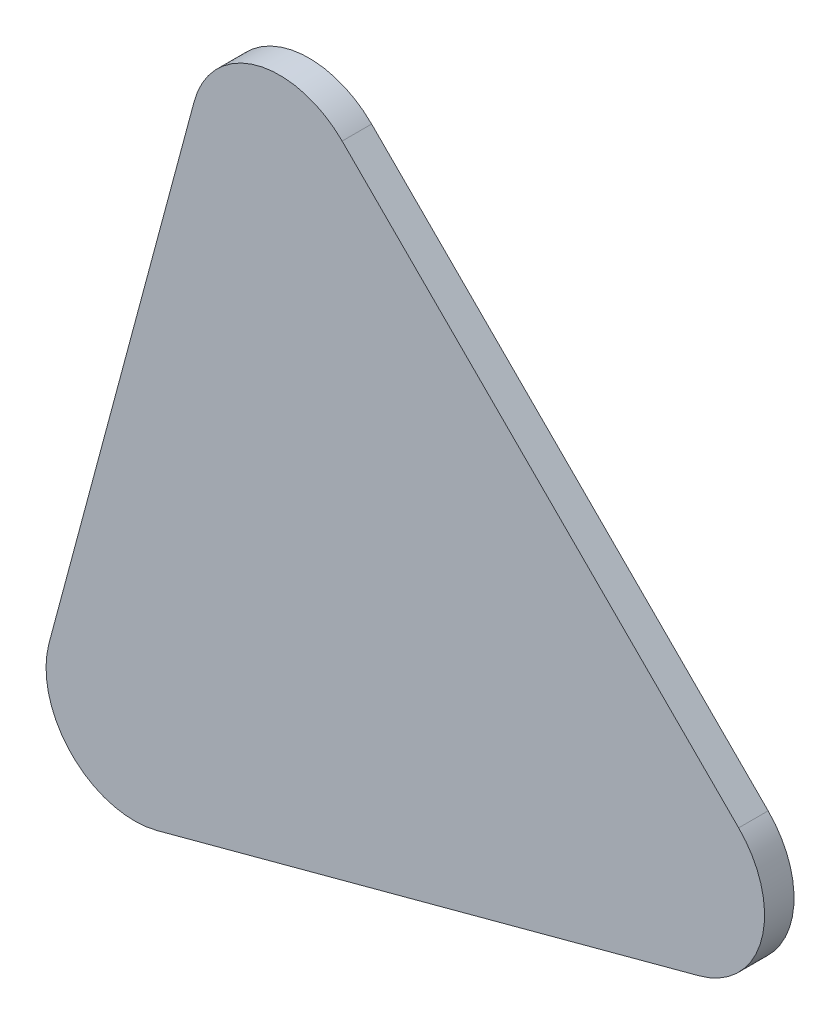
ISO-10303-21;
HEADER;
FILE_DESCRIPTION(('STEP AP214'),'2;1');
FILE_NAME('part.step','',(''),(''),'','','');
FILE_SCHEMA(('AUTOMOTIVE_DESIGN { 1 0 10303 214 1 1 1 1 }'));
ENDSEC;
DATA;
#1=APPLICATION_CONTEXT('core data for automotive mechanical design processes');
#2=APPLICATION_PROTOCOL_DEFINITION('international standard','automotive_design',2000,#1);
#3=PRODUCT_CONTEXT('',#1,'mechanical');
#4=PRODUCT('Part','Part','',(#3));
#5=PRODUCT_RELATED_PRODUCT_CATEGORY('part','',(#4));
#6=PRODUCT_DEFINITION_FORMATION('','',#4);
#7=PRODUCT_DEFINITION_CONTEXT('part definition',#1,'design');
#8=PRODUCT_DEFINITION('design','',#6,#7);
#9=PRODUCT_DEFINITION_SHAPE('','',#8);
#10=(LENGTH_UNIT() NAMED_UNIT(*) SI_UNIT(.MILLI.,.METRE.));
#11=(NAMED_UNIT(*) PLANE_ANGLE_UNIT() SI_UNIT($,.RADIAN.));
#12=(NAMED_UNIT(*) SI_UNIT($,.STERADIAN.) SOLID_ANGLE_UNIT());
#13=UNCERTAINTY_MEASURE_WITH_UNIT(LENGTH_MEASURE(1.E-05),#10,'distance_accuracy_value','');
#14=(GEOMETRIC_REPRESENTATION_CONTEXT(3) GLOBAL_UNCERTAINTY_ASSIGNED_CONTEXT((#13)) GLOBAL_UNIT_ASSIGNED_CONTEXT((#10,
#11,#12)) REPRESENTATION_CONTEXT('',''));
#15=CARTESIAN_POINT('',(0.,0.,0.));
#16=DIRECTION('',(0.,0.,1.));
#17=DIRECTION('',(1.,0.,0.));
#18=AXIS2_PLACEMENT_3D('',#15,#16,#17);
#19=CARTESIAN_POINT('',(-7.6135520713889,-28.4141631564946,1.));
#20=DIRECTION('',(0.965925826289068,-0.258819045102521,0.));
#21=DIRECTION('',(0.258819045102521,0.965925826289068,0.));
#22=AXIS2_PLACEMENT_3D('',#19,#20,#21);
#23=PLANE('',#22);
#24=DIRECTION('',(-0.258819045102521,-0.965925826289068,0.));
#25=VECTOR('',#24,1.);
#26=CARTESIAN_POINT('',(-7.6135520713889,-28.4141631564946,0.));
#27=LINE('',#26,#25);
#28=CARTESIAN_POINT('',(-1.34486320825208,-5.01909782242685,0.));
#29=VERTEX_POINT('',#28);
#30=CARTESIAN_POINT('',(-6.26868886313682,-23.3950653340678,0.));
#31=VERTEX_POINT('',#30);
#32=EDGE_CURVE('E112',#29,#31,#27,.T.);
#33=ORIENTED_EDGE('',*,*,#32,.T.);
#34=DIRECTION('',(0.,0.,-1.));
#35=VECTOR('',#34,1.);
#36=CARTESIAN_POINT('',(-6.26868886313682,-23.3950653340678,1.));
#37=LINE('',#36,#35);
#38=CARTESIAN_POINT('',(-6.26868886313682,-23.3950653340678,1.));
#39=VERTEX_POINT('',#38);
#40=EDGE_CURVE('E91',#31,#39,#37,.F.);
#41=ORIENTED_EDGE('',*,*,#40,.T.);
#42=DIRECTION('',(-0.258819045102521,-0.965925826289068,0.));
#43=VECTOR('',#42,1.);
#44=CARTESIAN_POINT('',(-7.6135520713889,-28.4141631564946,1.));
#45=LINE('',#44,#43);
#46=CARTESIAN_POINT('',(-1.34486320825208,-5.01909782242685,1.));
#47=VERTEX_POINT('',#46);
#48=EDGE_CURVE('E114',#47,#39,#45,.T.);
#49=ORIENTED_EDGE('',*,*,#48,.F.);
#50=DIRECTION('',(0.,0.,-1.));
#51=VECTOR('',#50,1.);
#52=CARTESIAN_POINT('',(-1.34486320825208,-5.01909782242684,1.));
#53=LINE('',#52,#51);
#54=EDGE_CURVE('E96',#47,#29,#53,.T.);
#55=ORIENTED_EDGE('',*,*,#54,.T.);
#56=EDGE_LOOP('',(#33,#41,#49,#55));
#57=FACE_BOUND('',#56,.T.);
#58=ADVANCED_FACE('F33',(#57),#23,.F.);
#59=CARTESIAN_POINT('',(20.8006110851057,-20.8006110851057,1.));
#60=DIRECTION('',(-0.258819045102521,0.965925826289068,0.));
#61=DIRECTION('',(-0.965925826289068,-0.258819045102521,0.));
#62=AXIS2_PLACEMENT_3D('',#59,#60,#61);
#63=PLANE('',#62);
#64=DIRECTION('',(0.965925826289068,0.258819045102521,0.));
#65=VECTOR('',#64,1.);
#66=CARTESIAN_POINT('',(20.8006110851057,-20.8006110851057,1.));
#67=LINE('',#66,#65);
#68=CARTESIAN_POINT('',(-2.59445424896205,-27.0692999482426,1.));
#69=VERTEX_POINT('',#68);
#70=CARTESIAN_POINT('',(15.7815132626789,-22.1454742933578,1.));
#71=VERTEX_POINT('',#70);
#72=EDGE_CURVE('E105',#69,#71,#67,.T.);
#73=ORIENTED_EDGE('',*,*,#72,.F.);
#74=DIRECTION('',(0.,0.,-1.));
#75=VECTOR('',#74,1.);
#76=CARTESIAN_POINT('',(-2.59445424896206,-27.0692999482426,1.));
#77=LINE('',#76,#75);
#78=CARTESIAN_POINT('',(-2.59445424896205,-27.0692999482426,0.));
#79=VERTEX_POINT('',#78);
#80=EDGE_CURVE('E90',#69,#79,#77,.T.);
#81=ORIENTED_EDGE('',*,*,#80,.T.);
#82=DIRECTION('',(0.965925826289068,0.258819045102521,0.));
#83=VECTOR('',#82,1.);
#84=CARTESIAN_POINT('',(20.8006110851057,-20.8006110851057,0.));
#85=LINE('',#84,#83);
#86=CARTESIAN_POINT('',(15.7815132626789,-22.1454742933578,0.));
#87=VERTEX_POINT('',#86);
#88=EDGE_CURVE('E103',#79,#87,#85,.T.);
#89=ORIENTED_EDGE('',*,*,#88,.T.);
#90=DIRECTION('',(0.,0.,-1.));
#91=VECTOR('',#90,1.);
#92=CARTESIAN_POINT('',(15.7815132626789,-22.1454742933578,1.));
#93=LINE('',#92,#91);
#94=EDGE_CURVE('E107',#87,#71,#93,.F.);
#95=ORIENTED_EDGE('',*,*,#94,.T.);
#96=EDGE_LOOP('',(#73,#81,#89,#95));
#97=FACE_BOUND('',#96,.T.);
#98=ADVANCED_FACE('F102',(#97),#63,.F.);
#99=CARTESIAN_POINT('',(0.,0.,1.));
#100=DIRECTION('',(-0.707106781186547,-0.707106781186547,0.));
#101=DIRECTION('',(0.707106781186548,-0.707106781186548,0.));
#102=AXIS2_PLACEMENT_3D('',#99,#100,#101);
#103=PLANE('',#102);
#104=DIRECTION('',(-0.707106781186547,0.707106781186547,0.));
#105=VECTOR('',#104,1.);
#106=CARTESIAN_POINT('',(0.,0.,0.));
#107=LINE('',#106,#105);
#108=CARTESIAN_POINT('',(17.126376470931,-17.126376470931,0.));
#109=VERTEX_POINT('',#108);
#110=CARTESIAN_POINT('',(3.67423461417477,-3.67423461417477,0.));
#111=VERTEX_POINT('',#110);
#112=EDGE_CURVE('E111',#109,#111,#107,.T.);
#113=ORIENTED_EDGE('',*,*,#112,.T.);
#114=DIRECTION('',(0.,0.,-1.));
#115=VECTOR('',#114,1.);
#116=CARTESIAN_POINT('',(3.67423461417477,-3.67423461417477,1.));
#117=LINE('',#116,#115);
#118=CARTESIAN_POINT('',(3.67423461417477,-3.67423461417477,1.));
#119=VERTEX_POINT('',#118);
#120=EDGE_CURVE('E11',#111,#119,#117,.F.);
#121=ORIENTED_EDGE('',*,*,#120,.T.);
#122=DIRECTION('',(-0.707106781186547,0.707106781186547,0.));
#123=VECTOR('',#122,1.);
#124=CARTESIAN_POINT('',(0.,0.,1.));
#125=LINE('',#124,#123);
#126=CARTESIAN_POINT('',(17.126376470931,-17.126376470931,1.));
#127=VERTEX_POINT('',#126);
#128=EDGE_CURVE('E119',#127,#119,#125,.T.);
#129=ORIENTED_EDGE('',*,*,#128,.F.);
#130=DIRECTION('',(0.,0.,-1.));
#131=VECTOR('',#130,1.);
#132=CARTESIAN_POINT('',(17.126376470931,-17.126376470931,1.));
#133=LINE('',#132,#131);
#134=EDGE_CURVE('E41',#127,#109,#133,.T.);
#135=ORIENTED_EDGE('',*,*,#134,.T.);
#136=EDGE_LOOP('',(#113,#121,#129,#135));
#137=FACE_BOUND('',#136,.T.);
#138=ADVANCED_FACE('F132',(#137),#103,.F.);
#139=CARTESIAN_POINT('',(0.,0.,1.));
#140=DIRECTION('',(0.,0.,-1.));
#141=DIRECTION('',(-1.,0.,0.));
#142=AXIS2_PLACEMENT_3D('',#139,#140,#141);
#143=PLANE('',#142);
#144=ORIENTED_EDGE('',*,*,#48,.T.);
#145=CARTESIAN_POINT('',(-3.37091138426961,-24.1715224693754,1.));
#146=DIRECTION('',(0.,0.,-1.));
#147=DIRECTION('',(-1.,0.,0.));
#148=AXIS2_PLACEMENT_3D('',#145,#146,#147);
#149=CIRCLE('',#148,3.);
#150=EDGE_CURVE('E129',#39,#69,#149,.F.);
#151=ORIENTED_EDGE('',*,*,#150,.T.);
#152=ORIENTED_EDGE('',*,*,#72,.T.);
#153=CARTESIAN_POINT('',(15.0050561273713,-19.2476968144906,1.));
#154=DIRECTION('',(0.,0.,-1.));
#155=DIRECTION('',(-1.,0.,0.));
#156=AXIS2_PLACEMENT_3D('',#153,#154,#155);
#157=CIRCLE('',#156,3.);
#158=EDGE_CURVE('E53',#71,#127,#157,.F.);
#159=ORIENTED_EDGE('',*,*,#158,.T.);
#160=ORIENTED_EDGE('',*,*,#128,.T.);
#161=CARTESIAN_POINT('',(1.55291427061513,-5.79555495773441,1.));
#162=DIRECTION('',(0.,0.,-1.));
#163=DIRECTION('',(-1.,0.,0.));
#164=AXIS2_PLACEMENT_3D('',#161,#162,#163);
#165=CIRCLE('',#164,3.);
#166=EDGE_CURVE('E127',#119,#47,#165,.F.);
#167=ORIENTED_EDGE('',*,*,#166,.T.);
#168=EDGE_LOOP('',(#144,#151,#152,#159,#160,#167));
#169=FACE_BOUND('',#168,.T.);
#170=ADVANCED_FACE('F143',(#169),#143,.F.);
#171=CARTESIAN_POINT('',(0.,0.,0.));
#172=DIRECTION('',(0.,0.,-1.));
#173=DIRECTION('',(-1.,0.,0.));
#174=AXIS2_PLACEMENT_3D('',#171,#172,#173);
#175=PLANE('',#174);
#176=ORIENTED_EDGE('',*,*,#88,.F.);
#177=CARTESIAN_POINT('',(-3.37091138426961,-24.1715224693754,0.));
#178=DIRECTION('',(0.,0.,-1.));
#179=DIRECTION('',(-1.,0.,0.));
#180=AXIS2_PLACEMENT_3D('',#177,#178,#179);
#181=CIRCLE('',#180,3.);
#182=EDGE_CURVE('E86',#79,#31,#181,.T.);
#183=ORIENTED_EDGE('',*,*,#182,.T.);
#184=ORIENTED_EDGE('',*,*,#32,.F.);
#185=CARTESIAN_POINT('',(1.55291427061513,-5.79555495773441,0.));
#186=DIRECTION('',(0.,0.,-1.));
#187=DIRECTION('',(-1.,0.,0.));
#188=AXIS2_PLACEMENT_3D('',#185,#186,#187);
#189=CIRCLE('',#188,3.);
#190=EDGE_CURVE('E97',#29,#111,#189,.T.);
#191=ORIENTED_EDGE('',*,*,#190,.T.);
#192=ORIENTED_EDGE('',*,*,#112,.F.);
#193=CARTESIAN_POINT('',(15.0050561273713,-19.2476968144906,0.));
#194=DIRECTION('',(0.,0.,-1.));
#195=DIRECTION('',(-1.,0.,0.));
#196=AXIS2_PLACEMENT_3D('',#193,#194,#195);
#197=CIRCLE('',#196,3.);
#198=EDGE_CURVE('E106',#109,#87,#197,.T.);
#199=ORIENTED_EDGE('',*,*,#198,.T.);
#200=EDGE_LOOP('',(#176,#183,#184,#191,#192,#199));
#201=FACE_BOUND('',#200,.T.);
#202=ADVANCED_FACE('F109',(#201),#175,.T.);
#203=CARTESIAN_POINT('',(-3.37091138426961,-24.1715224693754,1.));
#204=DIRECTION('',(0.,0.,-1.));
#205=DIRECTION('',(-1.,0.,0.));
#206=AXIS2_PLACEMENT_3D('',#203,#204,#205);
#207=CYLINDRICAL_SURFACE('',#206,3.);
#208=ORIENTED_EDGE('',*,*,#150,.F.);
#209=ORIENTED_EDGE('',*,*,#40,.F.);
#210=ORIENTED_EDGE('',*,*,#182,.F.);
#211=ORIENTED_EDGE('',*,*,#80,.F.);
#212=EDGE_LOOP('',(#208,#209,#210,#211));
#213=FACE_BOUND('',#212,.T.);
#214=ADVANCED_FACE('F89',(#213),#207,.T.);
#215=CARTESIAN_POINT('',(1.55291427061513,-5.79555495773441,1.));
#216=DIRECTION('',(0.,0.,-1.));
#217=DIRECTION('',(-1.,0.,0.));
#218=AXIS2_PLACEMENT_3D('',#215,#216,#217);
#219=CYLINDRICAL_SURFACE('',#218,3.);
#220=ORIENTED_EDGE('',*,*,#166,.F.);
#221=ORIENTED_EDGE('',*,*,#120,.F.);
#222=ORIENTED_EDGE('',*,*,#190,.F.);
#223=ORIENTED_EDGE('',*,*,#54,.F.);
#224=EDGE_LOOP('',(#220,#221,#222,#223));
#225=FACE_BOUND('',#224,.T.);
#226=ADVANCED_FACE('F137',(#225),#219,.T.);
#227=CARTESIAN_POINT('',(15.0050561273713,-19.2476968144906,1.));
#228=DIRECTION('',(0.,0.,-1.));
#229=DIRECTION('',(-1.,0.,0.));
#230=AXIS2_PLACEMENT_3D('',#227,#228,#229);
#231=CYLINDRICAL_SURFACE('',#230,3.);
#232=ORIENTED_EDGE('',*,*,#158,.F.);
#233=ORIENTED_EDGE('',*,*,#94,.F.);
#234=ORIENTED_EDGE('',*,*,#198,.F.);
#235=ORIENTED_EDGE('',*,*,#134,.F.);
#236=EDGE_LOOP('',(#232,#233,#234,#235));
#237=FACE_BOUND('',#236,.T.);
#238=ADVANCED_FACE('F35',(#237),#231,.T.);
#239=CLOSED_SHELL('',(#58,#98,#138,#170,#202,#214,#226,#238));
#240=MANIFOLD_SOLID_BREP('B2',#239);
#241=ADVANCED_BREP_SHAPE_REPRESENTATION('',(#18,#240),#14);
#242=SHAPE_DEFINITION_REPRESENTATION(#9,#241);
ENDSEC;
END-ISO-10303-21;
